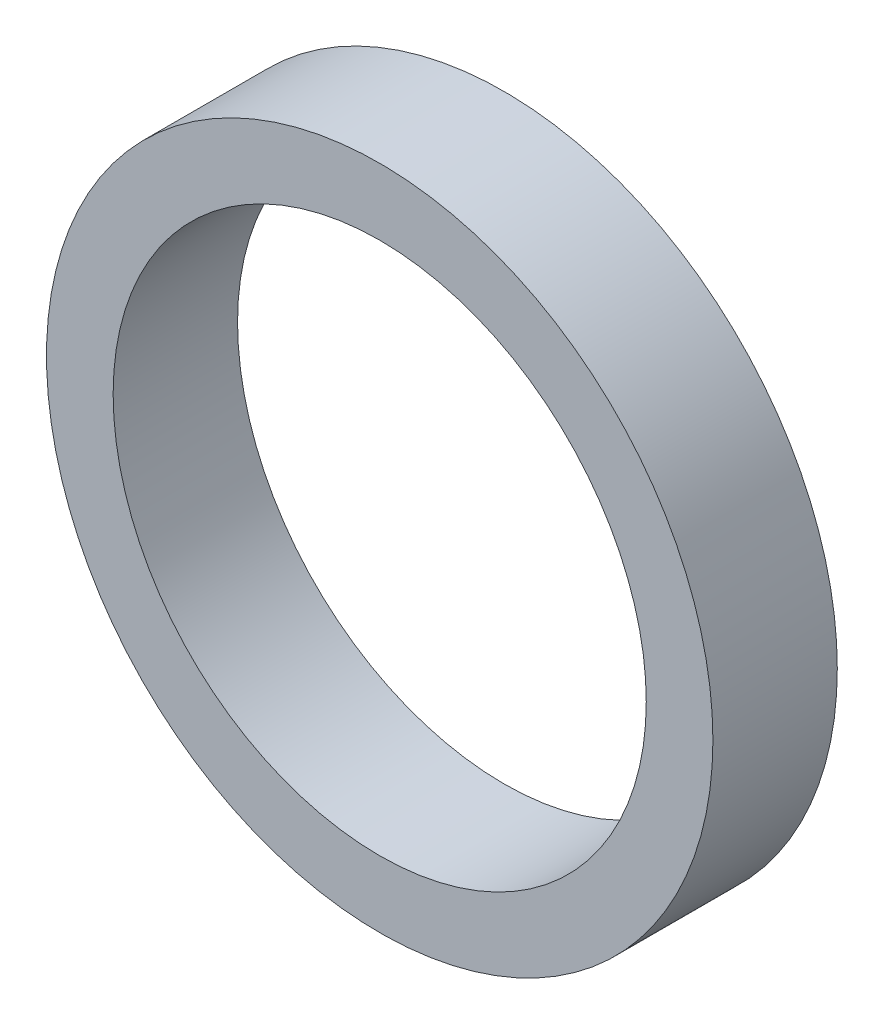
from build123d import *

# Parameters (mm, degrees)
ESQUISSE1_R      = 7.5
ESQUISSE1_R_2    = 6
EXTRUSION1_DEPTH = 1.4


with BuildPart() as part:
    # Esquisse1 → Extrusion1 (new, symmetric)
    with BuildSketch(Plane.XY):
        Circle(ESQUISSE1_R)
        Circle(ESQUISSE1_R_2, mode=Mode.SUBTRACT)
    extrude(amount=EXTRUSION1_DEPTH, both=True)


solid = part.part
